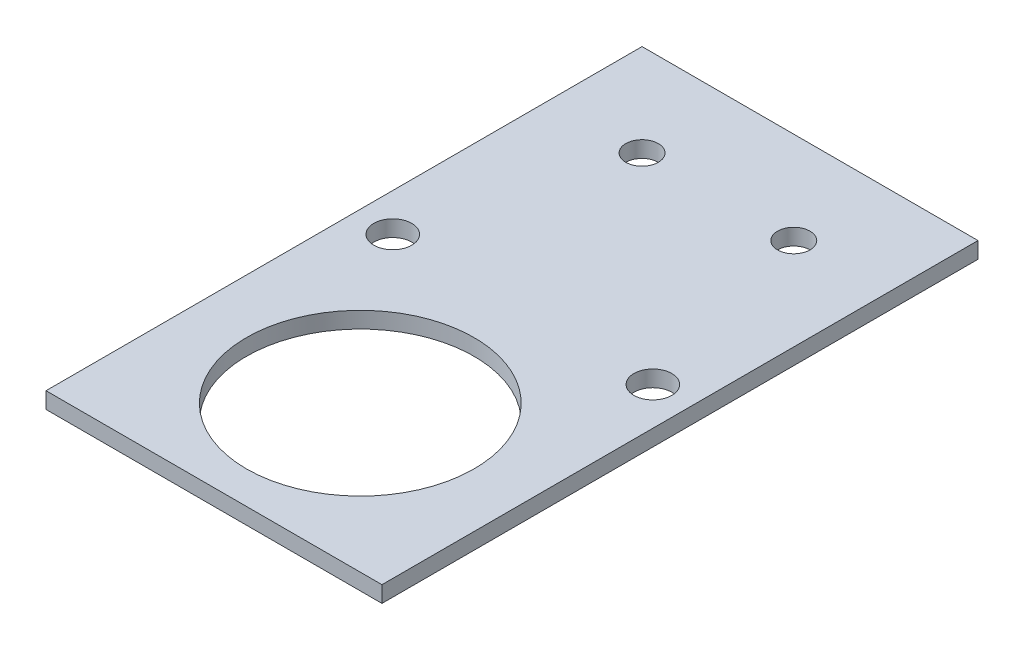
from build123d import *

# Parameters (mm, degrees)
SKETCH1_W      = 62
SKETCH1_H      = 110
SKETCH1_R      = 21
SKETCH1_R_2    = 3.5
SKETCH1_R_3    = 3
EXTRUDE1_DEPTH = 3


with BuildPart() as part:
    # Sketch1 → Extrude1 (new body)
    with BuildSketch(Plane(origin=(0, 0, 0), x_dir=(1, 0, 0), z_dir=(0, 1, 0))):
        with Locations((31, 55)):
            Rectangle(SKETCH1_W, SKETCH1_H)
        with Locations(Location((31, 27, 0), (0, 0, 270))):
            Circle(SKETCH1_R, mode=Mode.SUBTRACT)
        with Locations(Location((7, 57, 0), (0, 0, 270))):
            Circle(SKETCH1_R_2, mode=Mode.SUBTRACT)
        with Locations(Location((55, 57, 0), (0, 0, 270))):
            Circle(SKETCH1_R_2, mode=Mode.SUBTRACT)
        with Locations(Location((17, 93, 0), (0, 0, 270))):
            Circle(SKETCH1_R_3, mode=Mode.SUBTRACT)
        with Locations(Location((45, 93, 0), (0, 0, 270))):
            Circle(SKETCH1_R_3, mode=Mode.SUBTRACT)
    extrude(amount=EXTRUDE1_DEPTH)


solid = part.part
